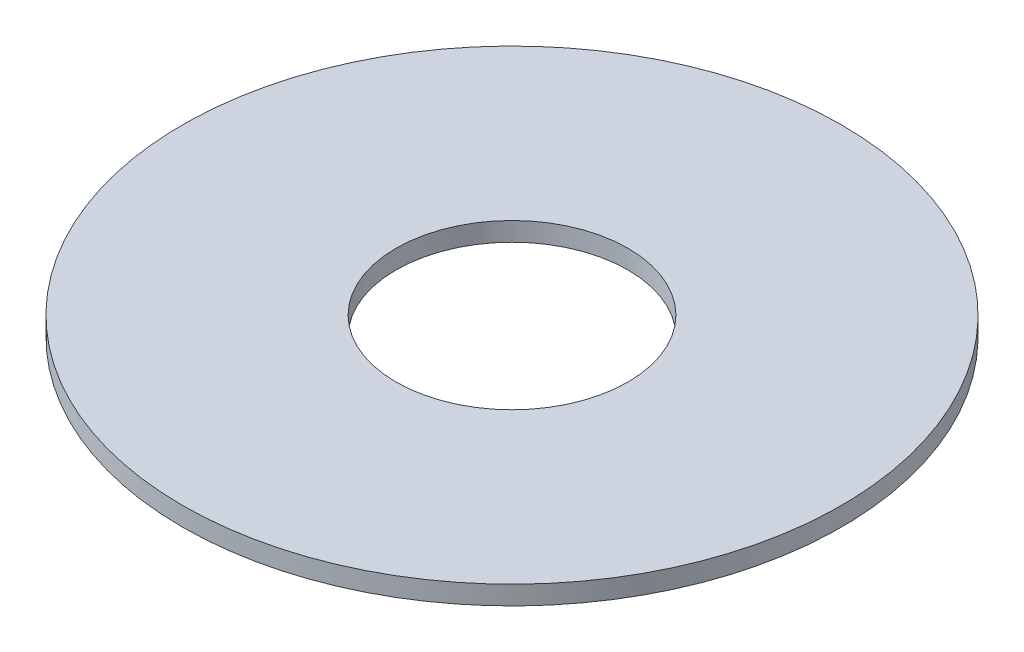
from build123d import *

# Parameters (mm, degrees)
SKETCH1_R          = 7.112
EXTRUDE1_DEPTH     = 0.4064
SKETCH2_R          = 2.5019
CUT_EXTRUDE1_DEPTH = 11.066094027


with BuildPart() as part:
    # Sketch1 → Extrude1 (new body)
    with BuildSketch(Plane(origin=(0, 0, 0), x_dir=(1, 0, 0), z_dir=(0, 1, 0))):
        with Locations(Location((0, 0, 0), (0, 0, 270))):
            Circle(SKETCH1_R)
    extrude(amount=EXTRUDE1_DEPTH)

    # Sketch2 → Cut-Extrude1 (cut, through all)
    with BuildSketch(Plane.XZ):
        with Locations(Location((0, 0, 0), (0, 0, 270))):
            Circle(SKETCH2_R)
    extrude(amount=-CUT_EXTRUDE1_DEPTH, mode=Mode.SUBTRACT)


solid = part.part
